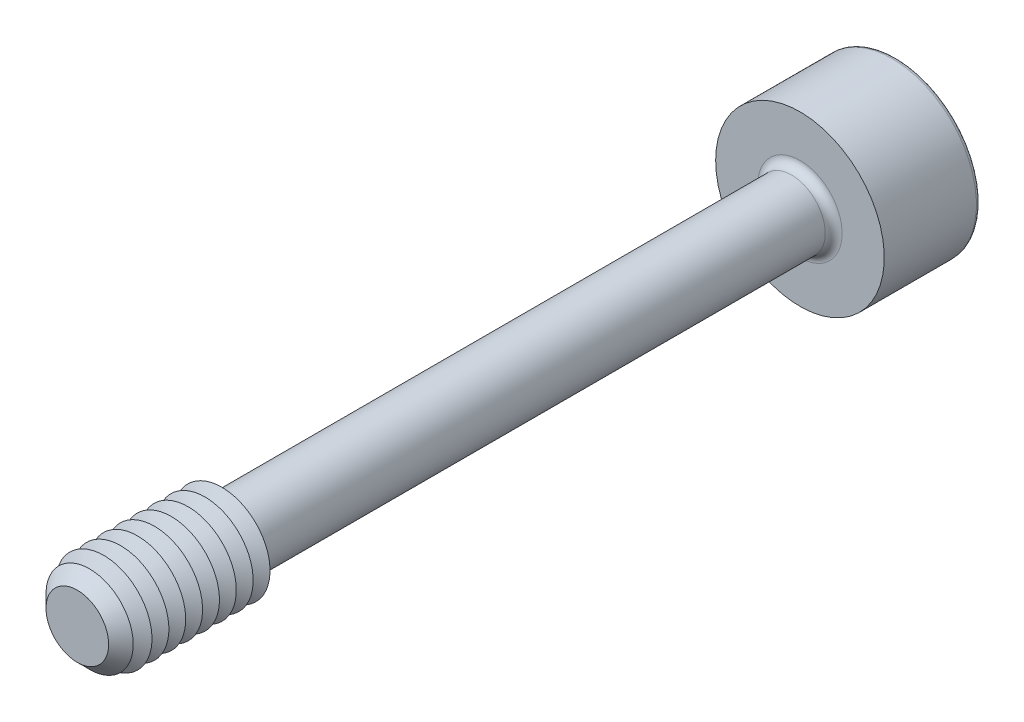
ISO-10303-21;
HEADER;
FILE_DESCRIPTION(('STEP AP214'),'2;1');
FILE_NAME('part.step','',(''),(''),'','','');
FILE_SCHEMA(('AUTOMOTIVE_DESIGN { 1 0 10303 214 1 1 1 1 }'));
ENDSEC;
DATA;
#1=APPLICATION_CONTEXT('core data for automotive mechanical design processes');
#2=APPLICATION_PROTOCOL_DEFINITION('international standard','automotive_design',2000,#1);
#3=PRODUCT_CONTEXT('',#1,'mechanical');
#4=PRODUCT('Part','Part','',(#3));
#5=PRODUCT_RELATED_PRODUCT_CATEGORY('part','',(#4));
#6=PRODUCT_DEFINITION_FORMATION('','',#4);
#7=PRODUCT_DEFINITION_CONTEXT('part definition',#1,'design');
#8=PRODUCT_DEFINITION('design','',#6,#7);
#9=PRODUCT_DEFINITION_SHAPE('','',#8);
#10=(LENGTH_UNIT() NAMED_UNIT(*) SI_UNIT(.MILLI.,.METRE.));
#11=(NAMED_UNIT(*) PLANE_ANGLE_UNIT() SI_UNIT($,.RADIAN.));
#12=(NAMED_UNIT(*) SI_UNIT($,.STERADIAN.) SOLID_ANGLE_UNIT());
#13=UNCERTAINTY_MEASURE_WITH_UNIT(LENGTH_MEASURE(1.E-05),#10,'distance_accuracy_value','');
#14=(GEOMETRIC_REPRESENTATION_CONTEXT(3) GLOBAL_UNCERTAINTY_ASSIGNED_CONTEXT((#13)) GLOBAL_UNIT_ASSIGNED_CONTEXT((#10,
#11,#12)) REPRESENTATION_CONTEXT('',''));
#15=CARTESIAN_POINT('',(0.,0.,0.));
#16=DIRECTION('',(0.,0.,1.));
#17=DIRECTION('',(1.,0.,0.));
#18=AXIS2_PLACEMENT_3D('',#15,#16,#17);
#19=CARTESIAN_POINT('',(-0.866025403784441,-1.5,-16.));
#20=DIRECTION('',(0.,0.,1.));
#21=DIRECTION('',(1.,0.,0.));
#22=AXIS2_PLACEMENT_3D('',#19,#20,#21);
#23=PLANE('',#22);
#24=DIRECTION('',(1.,0.,0.));
#25=VECTOR('',#24,1.);
#26=CARTESIAN_POINT('',(-0.866025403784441,-1.5,-16.));
#27=LINE('',#26,#25);
#28=CARTESIAN_POINT('',(0.,-1.5,-16.));
#29=VERTEX_POINT('',#28);
#30=CARTESIAN_POINT('',(0.866025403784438,-1.5,-16.));
#31=VERTEX_POINT('',#30);
#32=EDGE_CURVE('E762',#29,#31,#27,.T.);
#33=ORIENTED_EDGE('',*,*,#32,.F.);
#34=CARTESIAN_POINT('',(0.,0.,-16.));
#35=DIRECTION('',(0.,0.,1.));
#36=DIRECTION('',(0.,-1.,0.));
#37=AXIS2_PLACEMENT_3D('',#34,#35,#36);
#38=CIRCLE('',#37,1.5);
#39=CARTESIAN_POINT('',(1.29903810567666,-0.75,-16.));
#40=VERTEX_POINT('',#39);
#41=EDGE_CURVE('E53',#29,#40,#38,.T.);
#42=ORIENTED_EDGE('',*,*,#41,.T.);
#43=DIRECTION('',(0.5,0.866025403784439,0.));
#44=VECTOR('',#43,1.);
#45=CARTESIAN_POINT('',(0.866025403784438,-1.5,-16.));
#46=LINE('',#45,#44);
#47=EDGE_CURVE('E746',#31,#40,#46,.T.);
#48=ORIENTED_EDGE('',*,*,#47,.F.);
#49=EDGE_LOOP('',(#33,#42,#48));
#50=FACE_BOUND('',#49,.T.);
#51=ADVANCED_FACE('F41',(#50),#23,.F.);
#52=CARTESIAN_POINT('',(1.73205080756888,0.,-16.));
#53=VERTEX_POINT('',#52);
#54=EDGE_CURVE('E758',#40,#53,#46,.T.);
#55=ORIENTED_EDGE('',*,*,#54,.F.);
#56=CARTESIAN_POINT('',(1.29903810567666,0.749999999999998,-16.));
#57=VERTEX_POINT('',#56);
#58=EDGE_CURVE('E11',#40,#57,#38,.T.);
#59=ORIENTED_EDGE('',*,*,#58,.T.);
#60=DIRECTION('',(-0.5,0.866025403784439,0.));
#61=VECTOR('',#60,1.);
#62=CARTESIAN_POINT('',(1.73205080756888,0.,-16.));
#63=LINE('',#62,#61);
#64=EDGE_CURVE('E745',#53,#57,#63,.T.);
#65=ORIENTED_EDGE('',*,*,#64,.F.);
#66=EDGE_LOOP('',(#55,#59,#65));
#67=FACE_BOUND('',#66,.T.);
#68=ADVANCED_FACE('F133',(#67),#23,.F.);
#69=CARTESIAN_POINT('',(0.866025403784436,1.5,-16.));
#70=VERTEX_POINT('',#69);
#71=EDGE_CURVE('E740',#57,#70,#63,.T.);
#72=ORIENTED_EDGE('',*,*,#71,.F.);
#73=CARTESIAN_POINT('',(0.,1.5,-16.));
#74=VERTEX_POINT('',#73);
#75=EDGE_CURVE('E51',#57,#74,#38,.T.);
#76=ORIENTED_EDGE('',*,*,#75,.T.);
#77=DIRECTION('',(-1.,0.,0.));
#78=VECTOR('',#77,1.);
#79=CARTESIAN_POINT('',(0.866025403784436,1.5,-16.));
#80=LINE('',#79,#78);
#81=EDGE_CURVE('E177',#70,#74,#80,.T.);
#82=ORIENTED_EDGE('',*,*,#81,.F.);
#83=EDGE_LOOP('',(#72,#76,#82));
#84=FACE_BOUND('',#83,.T.);
#85=ADVANCED_FACE('F139',(#84),#23,.F.);
#86=CARTESIAN_POINT('',(-0.866025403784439,1.5,-16.));
#87=VERTEX_POINT('',#86);
#88=EDGE_CURVE('E751',#74,#87,#80,.T.);
#89=ORIENTED_EDGE('',*,*,#88,.F.);
#90=CARTESIAN_POINT('',(-1.29903810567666,0.749999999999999,-16.));
#91=VERTEX_POINT('',#90);
#92=EDGE_CURVE('E264',#74,#91,#38,.T.);
#93=ORIENTED_EDGE('',*,*,#92,.T.);
#94=DIRECTION('',(-0.5,-0.866025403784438,0.));
#95=VECTOR('',#94,1.);
#96=CARTESIAN_POINT('',(-0.866025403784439,1.5,-16.));
#97=LINE('',#96,#95);
#98=EDGE_CURVE('E176',#87,#91,#97,.T.);
#99=ORIENTED_EDGE('',*,*,#98,.F.);
#100=EDGE_LOOP('',(#89,#93,#99));
#101=FACE_BOUND('',#100,.T.);
#102=ADVANCED_FACE('F157',(#101),#23,.F.);
#103=CARTESIAN_POINT('',(-1.73205080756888,0.,-16.));
#104=VERTEX_POINT('',#103);
#105=EDGE_CURVE('E170',#91,#104,#97,.T.);
#106=ORIENTED_EDGE('',*,*,#105,.F.);
#107=CARTESIAN_POINT('',(-1.29903810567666,-0.749999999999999,-16.));
#108=VERTEX_POINT('',#107);
#109=EDGE_CURVE('E172',#91,#108,#38,.T.);
#110=ORIENTED_EDGE('',*,*,#109,.T.);
#111=DIRECTION('',(0.5,-0.866025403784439,0.));
#112=VECTOR('',#111,1.);
#113=CARTESIAN_POINT('',(-1.73205080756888,0.,-16.));
#114=LINE('',#113,#112);
#115=EDGE_CURVE('E174',#104,#108,#114,.T.);
#116=ORIENTED_EDGE('',*,*,#115,.F.);
#117=EDGE_LOOP('',(#106,#110,#116));
#118=FACE_BOUND('',#117,.T.);
#119=ADVANCED_FACE('F146',(#118),#23,.F.);
#120=CARTESIAN_POINT('',(0.,0.,-19.));
#121=DIRECTION('',(0.,0.,-1.));
#122=DIRECTION('',(-1.,0.,0.));
#123=AXIS2_PLACEMENT_3D('',#120,#121,#122);
#124=PLANE('',#123);
#125=CARTESIAN_POINT('',(0.,0.,-19.));
#126=DIRECTION('',(0.,0.,-1.));
#127=DIRECTION('',(-1.,0.,0.));
#128=AXIS2_PLACEMENT_3D('',#125,#126,#127);
#129=CIRCLE('',#128,3.325);
#130=CARTESIAN_POINT('',(-3.325,0.,-19.));
#131=VERTEX_POINT('',#130);
#132=EDGE_CURVE('E251',#131,#131,#129,.T.);
#133=ORIENTED_EDGE('',*,*,#132,.T.);
#134=EDGE_LOOP('',(#133));
#135=FACE_BOUND('',#134,.T.);
#136=DIRECTION('',(-0.5,-0.866025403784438,0.));
#137=VECTOR('',#136,1.);
#138=CARTESIAN_POINT('',(-0.866025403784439,1.5,-19.));
#139=LINE('',#138,#137);
#140=CARTESIAN_POINT('',(-0.866025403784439,1.5,-19.));
#141=VERTEX_POINT('',#140);
#142=CARTESIAN_POINT('',(-1.73205080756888,0.,-19.));
#143=VERTEX_POINT('',#142);
#144=EDGE_CURVE('E212',#141,#143,#139,.T.);
#145=ORIENTED_EDGE('',*,*,#144,.T.);
#146=DIRECTION('',(0.5,-0.866025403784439,0.));
#147=VECTOR('',#146,1.);
#148=CARTESIAN_POINT('',(-1.73205080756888,0.,-19.));
#149=LINE('',#148,#147);
#150=CARTESIAN_POINT('',(-0.866025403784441,-1.5,-19.));
#151=VERTEX_POINT('',#150);
#152=EDGE_CURVE('E67',#143,#151,#149,.T.);
#153=ORIENTED_EDGE('',*,*,#152,.T.);
#154=DIRECTION('',(1.,0.,0.));
#155=VECTOR('',#154,1.);
#156=CARTESIAN_POINT('',(-0.866025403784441,-1.5,-19.));
#157=LINE('',#156,#155);
#158=CARTESIAN_POINT('',(0.866025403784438,-1.5,-19.));
#159=VERTEX_POINT('',#158);
#160=EDGE_CURVE('E196',#151,#159,#157,.T.);
#161=ORIENTED_EDGE('',*,*,#160,.T.);
#162=DIRECTION('',(0.5,0.866025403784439,0.));
#163=VECTOR('',#162,1.);
#164=CARTESIAN_POINT('',(0.866025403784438,-1.5,-19.));
#165=LINE('',#164,#163);
#166=CARTESIAN_POINT('',(1.73205080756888,0.,-19.));
#167=VERTEX_POINT('',#166);
#168=EDGE_CURVE('E200',#159,#167,#165,.T.);
#169=ORIENTED_EDGE('',*,*,#168,.T.);
#170=DIRECTION('',(-0.5,0.866025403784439,0.));
#171=VECTOR('',#170,1.);
#172=CARTESIAN_POINT('',(1.73205080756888,0.,-19.));
#173=LINE('',#172,#171);
#174=CARTESIAN_POINT('',(0.866025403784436,1.5,-19.));
#175=VERTEX_POINT('',#174);
#176=EDGE_CURVE('E204',#167,#175,#173,.T.);
#177=ORIENTED_EDGE('',*,*,#176,.T.);
#178=DIRECTION('',(-1.,0.,0.));
#179=VECTOR('',#178,1.);
#180=CARTESIAN_POINT('',(0.866025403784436,1.5,-19.));
#181=LINE('',#180,#179);
#182=EDGE_CURVE('E208',#175,#141,#181,.T.);
#183=ORIENTED_EDGE('',*,*,#182,.T.);
#184=EDGE_LOOP('',(#145,#153,#161,#169,#177,#183));
#185=FACE_BOUND('',#184,.T.);
#186=ADVANCED_FACE('F156',(#135,#185),#124,.T.);
#187=CARTESIAN_POINT('',(0.,0.,15.));
#188=DIRECTION('',(0.,0.,-1.));
#189=DIRECTION('',(-1.,0.,0.));
#190=AXIS2_PLACEMENT_3D('',#187,#188,#189);
#191=CYLINDRICAL_SURFACE('',#190,1.4);
#192=CARTESIAN_POINT('',(0.,0.,-14.65));
#193=DIRECTION('',(0.,0.,-1.));
#194=DIRECTION('',(-1.,0.,0.));
#195=AXIS2_PLACEMENT_3D('',#192,#193,#194);
#196=CIRCLE('',#195,1.4);
#197=CARTESIAN_POINT('',(-1.4,0.,-14.65));
#198=VERTEX_POINT('',#197);
#199=EDGE_CURVE('E247',#198,#198,#196,.F.);
#200=ORIENTED_EDGE('',*,*,#199,.T.);
#201=EDGE_LOOP('',(#200));
#202=FACE_BOUND('',#201,.T.);
#203=CARTESIAN_POINT('',(0.,0.,8.65358983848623));
#204=DIRECTION('',(0.,0.,-1.));
#205=DIRECTION('',(0.,1.,0.));
#206=AXIS2_PLACEMENT_3D('',#203,#204,#205);
#207=CIRCLE('',#206,1.4);
#208=CARTESIAN_POINT('',(0.,1.4,8.65358983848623));
#209=VERTEX_POINT('',#208);
#210=EDGE_CURVE('E235',#209,#209,#207,.T.);
#211=ORIENTED_EDGE('',*,*,#210,.T.);
#212=EDGE_LOOP('',(#211));
#213=FACE_BOUND('',#212,.T.);
#214=ADVANCED_FACE('F163',(#202,#213),#191,.T.);
#215=CARTESIAN_POINT('',(0.,0.,8.65358983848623));
#216=DIRECTION('',(0.,0.,1.));
#217=DIRECTION('',(0.,-1.,0.));
#218=AXIS2_PLACEMENT_3D('',#215,#216,#217);
#219=CONICAL_SURFACE('',#218,1.4,1.0471975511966);
#220=CARTESIAN_POINT('',(0.,0.,9.));
#221=DIRECTION('',(0.,0.,-1.));
#222=DIRECTION('',(-1.,0.,0.));
#223=AXIS2_PLACEMENT_3D('',#220,#221,#222);
#224=CIRCLE('',#223,2.);
#225=CARTESIAN_POINT('',(-2.,0.,9.));
#226=VERTEX_POINT('',#225);
#227=EDGE_CURVE('E267',#226,#226,#224,.T.);
#228=ORIENTED_EDGE('',*,*,#227,.T.);
#229=EDGE_LOOP('',(#228));
#230=FACE_BOUND('',#229,.T.);
#231=ORIENTED_EDGE('',*,*,#210,.F.);
#232=EDGE_LOOP('',(#231));
#233=FACE_BOUND('',#232,.T.);
#234=ADVANCED_FACE('F509',(#230,#233),#219,.T.);
#235=CARTESIAN_POINT('',(0.,0.,-15.));
#236=DIRECTION('',(0.,0.,-1.));
#237=DIRECTION('',(-1.,0.,0.));
#238=AXIS2_PLACEMENT_3D('',#235,#236,#237);
#239=PLANE('',#238);
#240=CARTESIAN_POINT('',(0.,0.,-15.));
#241=DIRECTION('',(0.,0.,-1.));
#242=DIRECTION('',(-1.,0.,0.));
#243=AXIS2_PLACEMENT_3D('',#240,#241,#242);
#244=CIRCLE('',#243,1.75);
#245=CARTESIAN_POINT('',(-1.75,0.,-15.));
#246=VERTEX_POINT('',#245);
#247=EDGE_CURVE('E243',#246,#246,#244,.T.);
#248=ORIENTED_EDGE('',*,*,#247,.T.);
#249=EDGE_LOOP('',(#248));
#250=FACE_BOUND('',#249,.T.);
#251=CARTESIAN_POINT('',(0.,0.,-15.));
#252=DIRECTION('',(0.,0.,-1.));
#253=DIRECTION('',(-1.,0.,0.));
#254=AXIS2_PLACEMENT_3D('',#251,#252,#253);
#255=CIRCLE('',#254,3.5);
#256=CARTESIAN_POINT('',(-3.5,0.,-15.));
#257=VERTEX_POINT('',#256);
#258=EDGE_CURVE('E231',#257,#257,#255,.T.);
#259=ORIENTED_EDGE('',*,*,#258,.F.);
#260=EDGE_LOOP('',(#259));
#261=FACE_BOUND('',#260,.T.);
#262=ADVANCED_FACE('F502',(#250,#261),#239,.F.);
#263=CARTESIAN_POINT('',(0.,0.,-19.));
#264=DIRECTION('',(0.,0.,1.));
#265=DIRECTION('',(1.,0.,0.));
#266=AXIS2_PLACEMENT_3D('',#263,#264,#265);
#267=CYLINDRICAL_SURFACE('',#266,3.5);
#268=CARTESIAN_POINT('',(0.,0.,-18.825));
#269=DIRECTION('',(0.,0.,-1.));
#270=DIRECTION('',(-1.,0.,0.));
#271=AXIS2_PLACEMENT_3D('',#268,#269,#270);
#272=CIRCLE('',#271,3.5);
#273=CARTESIAN_POINT('',(-3.5,0.,-18.825));
#274=VERTEX_POINT('',#273);
#275=EDGE_CURVE('E254',#274,#274,#272,.F.);
#276=ORIENTED_EDGE('',*,*,#275,.T.);
#277=EDGE_LOOP('',(#276));
#278=FACE_BOUND('',#277,.T.);
#279=ORIENTED_EDGE('',*,*,#258,.T.);
#280=EDGE_LOOP('',(#279));
#281=FACE_BOUND('',#280,.T.);
#282=ADVANCED_FACE('F508',(#278,#281),#267,.T.);
#283=CARTESIAN_POINT('',(-1.73205080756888,0.,-16.));
#284=DIRECTION('',(0.866025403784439,0.5,0.));
#285=DIRECTION('',(-0.5,0.866025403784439,0.));
#286=AXIS2_PLACEMENT_3D('',#283,#284,#285);
#287=PLANE('',#286);
#288=ORIENTED_EDGE('',*,*,#152,.F.);
#289=DIRECTION('',(0.,0.,-1.));
#290=VECTOR('',#289,1.);
#291=CARTESIAN_POINT('',(-1.73205080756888,0.,-16.));
#292=LINE('',#291,#290);
#293=EDGE_CURVE('E186',#104,#143,#292,.T.);
#294=ORIENTED_EDGE('',*,*,#293,.F.);
#295=ORIENTED_EDGE('',*,*,#115,.T.);
#296=CARTESIAN_POINT('',(-0.866025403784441,-1.5,-16.));
#297=VERTEX_POINT('',#296);
#298=EDGE_CURVE('E215',#108,#297,#114,.T.);
#299=ORIENTED_EDGE('',*,*,#298,.T.);
#300=DIRECTION('',(0.,0.,-1.));
#301=VECTOR('',#300,1.);
#302=CARTESIAN_POINT('',(-0.866025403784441,-1.5,-16.));
#303=LINE('',#302,#301);
#304=EDGE_CURVE('E228',#297,#151,#303,.T.);
#305=ORIENTED_EDGE('',*,*,#304,.T.);
#306=EDGE_LOOP('',(#288,#294,#295,#299,#305));
#307=FACE_BOUND('',#306,.T.);
#308=ADVANCED_FACE('F520',(#307),#287,.T.);
#309=CARTESIAN_POINT('',(-0.866025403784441,-1.5,-16.));
#310=DIRECTION('',(0.,1.,0.));
#311=DIRECTION('',(0.,0.,1.));
#312=AXIS2_PLACEMENT_3D('',#309,#310,#311);
#313=PLANE('',#312);
#314=ORIENTED_EDGE('',*,*,#160,.F.);
#315=ORIENTED_EDGE('',*,*,#304,.F.);
#316=EDGE_CURVE('E759',#297,#29,#27,.T.);
#317=ORIENTED_EDGE('',*,*,#316,.T.);
#318=ORIENTED_EDGE('',*,*,#32,.T.);
#319=DIRECTION('',(0.,0.,-1.));
#320=VECTOR('',#319,1.);
#321=CARTESIAN_POINT('',(0.866025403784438,-1.5,-16.));
#322=LINE('',#321,#320);
#323=EDGE_CURVE('E225',#31,#159,#322,.T.);
#324=ORIENTED_EDGE('',*,*,#323,.T.);
#325=EDGE_LOOP('',(#314,#315,#317,#318,#324));
#326=FACE_BOUND('',#325,.T.);
#327=ADVANCED_FACE('F536',(#326),#313,.T.);
#328=CARTESIAN_POINT('',(0.866025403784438,-1.5,-16.));
#329=DIRECTION('',(-0.866025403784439,0.5,0.));
#330=DIRECTION('',(-0.5,-0.866025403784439,0.));
#331=AXIS2_PLACEMENT_3D('',#328,#329,#330);
#332=PLANE('',#331);
#333=ORIENTED_EDGE('',*,*,#168,.F.);
#334=ORIENTED_EDGE('',*,*,#323,.F.);
#335=ORIENTED_EDGE('',*,*,#47,.T.);
#336=ORIENTED_EDGE('',*,*,#54,.T.);
#337=DIRECTION('',(0.,0.,-1.));
#338=VECTOR('',#337,1.);
#339=CARTESIAN_POINT('',(1.73205080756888,0.,-16.));
#340=LINE('',#339,#338);
#341=EDGE_CURVE('E222',#53,#167,#340,.T.);
#342=ORIENTED_EDGE('',*,*,#341,.T.);
#343=EDGE_LOOP('',(#333,#334,#335,#336,#342));
#344=FACE_BOUND('',#343,.T.);
#345=ADVANCED_FACE('F546',(#344),#332,.T.);
#346=CARTESIAN_POINT('',(1.73205080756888,0.,-16.));
#347=DIRECTION('',(-0.866025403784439,-0.5,0.));
#348=DIRECTION('',(0.5,-0.866025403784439,0.));
#349=AXIS2_PLACEMENT_3D('',#346,#347,#348);
#350=PLANE('',#349);
#351=ORIENTED_EDGE('',*,*,#176,.F.);
#352=ORIENTED_EDGE('',*,*,#341,.F.);
#353=ORIENTED_EDGE('',*,*,#64,.T.);
#354=ORIENTED_EDGE('',*,*,#71,.T.);
#355=DIRECTION('',(0.,0.,-1.));
#356=VECTOR('',#355,1.);
#357=CARTESIAN_POINT('',(0.866025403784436,1.5,-16.));
#358=LINE('',#357,#356);
#359=EDGE_CURVE('E219',#70,#175,#358,.T.);
#360=ORIENTED_EDGE('',*,*,#359,.T.);
#361=EDGE_LOOP('',(#351,#352,#353,#354,#360));
#362=FACE_BOUND('',#361,.T.);
#363=ADVANCED_FACE('F556',(#362),#350,.T.);
#364=CARTESIAN_POINT('',(0.866025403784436,1.5,-16.));
#365=DIRECTION('',(0.,-1.,0.));
#366=DIRECTION('',(0.,0.,-1.));
#367=AXIS2_PLACEMENT_3D('',#364,#365,#366);
#368=PLANE('',#367);
#369=ORIENTED_EDGE('',*,*,#182,.F.);
#370=ORIENTED_EDGE('',*,*,#359,.F.);
#371=ORIENTED_EDGE('',*,*,#81,.T.);
#372=ORIENTED_EDGE('',*,*,#88,.T.);
#373=DIRECTION('',(0.,0.,-1.));
#374=VECTOR('',#373,1.);
#375=CARTESIAN_POINT('',(-0.866025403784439,1.5,-16.));
#376=LINE('',#375,#374);
#377=EDGE_CURVE('E182',#87,#141,#376,.T.);
#378=ORIENTED_EDGE('',*,*,#377,.T.);
#379=EDGE_LOOP('',(#369,#370,#371,#372,#378));
#380=FACE_BOUND('',#379,.T.);
#381=ADVANCED_FACE('F152',(#380),#368,.T.);
#382=CARTESIAN_POINT('',(-0.866025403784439,1.5,-16.));
#383=DIRECTION('',(0.866025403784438,-0.5,0.));
#384=DIRECTION('',(0.5,0.866025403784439,0.));
#385=AXIS2_PLACEMENT_3D('',#382,#383,#384);
#386=PLANE('',#385);
#387=ORIENTED_EDGE('',*,*,#144,.F.);
#388=ORIENTED_EDGE('',*,*,#377,.F.);
#389=ORIENTED_EDGE('',*,*,#98,.T.);
#390=ORIENTED_EDGE('',*,*,#105,.T.);
#391=ORIENTED_EDGE('',*,*,#293,.T.);
#392=EDGE_LOOP('',(#387,#388,#389,#390,#391));
#393=FACE_BOUND('',#392,.T.);
#394=ADVANCED_FACE('F144',(#393),#386,.T.);
#395=ORIENTED_EDGE('',*,*,#298,.F.);
#396=EDGE_CURVE('E257',#108,#29,#38,.T.);
#397=ORIENTED_EDGE('',*,*,#396,.T.);
#398=ORIENTED_EDGE('',*,*,#316,.F.);
#399=EDGE_LOOP('',(#395,#397,#398));
#400=FACE_BOUND('',#399,.T.);
#401=ADVANCED_FACE('F135',(#400),#23,.F.);
#402=CARTESIAN_POINT('',(0.,0.,-14.65));
#403=DIRECTION('',(0.,0.,-1.));
#404=DIRECTION('',(-1.,0.,0.));
#405=AXIS2_PLACEMENT_3D('',#402,#403,#404);
#406=TOROIDAL_SURFACE('',#405,1.75,0.35);
#407=ORIENTED_EDGE('',*,*,#199,.F.);
#408=EDGE_LOOP('',(#407));
#409=FACE_BOUND('',#408,.T.);
#410=ORIENTED_EDGE('',*,*,#247,.F.);
#411=EDGE_LOOP('',(#410));
#412=FACE_BOUND('',#411,.T.);
#413=ADVANCED_FACE('F129',(#409,#412),#406,.F.);
#414=CARTESIAN_POINT('',(0.,0.,-18.825));
#415=DIRECTION('',(0.,0.,-1.));
#416=DIRECTION('',(-1.,0.,0.));
#417=AXIS2_PLACEMENT_3D('',#414,#415,#416);
#418=TOROIDAL_SURFACE('',#417,3.325,0.175);
#419=ORIENTED_EDGE('',*,*,#275,.F.);
#420=EDGE_LOOP('',(#419));
#421=FACE_BOUND('',#420,.T.);
#422=ORIENTED_EDGE('',*,*,#132,.F.);
#423=EDGE_LOOP('',(#422));
#424=FACE_BOUND('',#423,.T.);
#425=ADVANCED_FACE('F43',(#421,#424),#418,.T.);
#426=CARTESIAN_POINT('',(0.,0.,-15.1339745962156));
#427=DIRECTION('',(0.,0.,-1.));
#428=DIRECTION('',(0.,1.,0.));
#429=AXIS2_PLACEMENT_3D('',#426,#427,#428);
#430=CONICAL_SURFACE('',#429,0.,1.0471975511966);
#431=ORIENTED_EDGE('',*,*,#41,.F.);
#432=ORIENTED_EDGE('',*,*,#396,.F.);
#433=ORIENTED_EDGE('',*,*,#109,.F.);
#434=ORIENTED_EDGE('',*,*,#92,.F.);
#435=ORIENTED_EDGE('',*,*,#75,.F.);
#436=ORIENTED_EDGE('',*,*,#58,.F.);
#437=EDGE_LOOP('',(#431,#432,#433,#434,#435,#436));
#438=FACE_BOUND('',#437,.T.);
#439=CARTESIAN_POINT('',(0.,0.,-15.1339745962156));
#440=VERTEX_POINT('',#439);
#441=VERTEX_LOOP('',#440);
#442=FACE_BOUND('',#441,.T.);
#443=ADVANCED_FACE('F118',(#438,#442),#430,.F.);
#444=CARTESIAN_POINT('',(0.,0.,9.35));
#445=DIRECTION('',(0.,0.,-1.));
#446=DIRECTION('',(-1.,0.,0.));
#447=AXIS2_PLACEMENT_3D('',#444,#445,#446);
#448=CONICAL_SURFACE('',#447,1.39378221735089,1.0471975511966);
#449=ORIENTED_EDGE('',*,*,#227,.F.);
#450=EDGE_LOOP('',(#449));
#451=FACE_BOUND('',#450,.T.);
#452=CARTESIAN_POINT('',(0.,0.,9.35));
#453=DIRECTION('',(0.,0.,-1.));
#454=DIRECTION('',(-1.,0.,0.));
#455=AXIS2_PLACEMENT_3D('',#452,#453,#454);
#456=CIRCLE('',#455,1.39378221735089);
#457=CARTESIAN_POINT('',(-1.39378221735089,0.,9.35));
#458=VERTEX_POINT('',#457);
#459=EDGE_CURVE('E272',#458,#458,#456,.T.);
#460=ORIENTED_EDGE('',*,*,#459,.T.);
#461=EDGE_LOOP('',(#460));
#462=FACE_BOUND('',#461,.T.);
#463=ADVANCED_FACE('F120',(#451,#462),#448,.T.);
#464=CARTESIAN_POINT('',(0.,0.,9.7));
#465=DIRECTION('',(0.,0.,1.));
#466=DIRECTION('',(1.,0.,0.));
#467=AXIS2_PLACEMENT_3D('',#464,#465,#466);
#468=CONICAL_SURFACE('',#467,2.,1.0471975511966);
#469=ORIENTED_EDGE('',*,*,#459,.F.);
#470=EDGE_LOOP('',(#469));
#471=FACE_BOUND('',#470,.T.);
#472=CARTESIAN_POINT('',(0.,0.,9.7));
#473=DIRECTION('',(0.,0.,-1.));
#474=DIRECTION('',(-1.,0.,0.));
#475=AXIS2_PLACEMENT_3D('',#472,#473,#474);
#476=CIRCLE('',#475,2.);
#477=CARTESIAN_POINT('',(-2.,0.,9.7));
#478=VERTEX_POINT('',#477);
#479=EDGE_CURVE('E278',#478,#478,#476,.T.);
#480=ORIENTED_EDGE('',*,*,#479,.T.);
#481=EDGE_LOOP('',(#480));
#482=FACE_BOUND('',#481,.T.);
#483=ADVANCED_FACE('F126',(#471,#482),#468,.T.);
#484=CARTESIAN_POINT('',(0.,0.,10.05));
#485=DIRECTION('',(0.,0.,-1.));
#486=DIRECTION('',(-1.,0.,0.));
#487=AXIS2_PLACEMENT_3D('',#484,#485,#486);
#488=CONICAL_SURFACE('',#487,1.39378221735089,1.0471975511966);
#489=ORIENTED_EDGE('',*,*,#479,.F.);
#490=EDGE_LOOP('',(#489));
#491=FACE_BOUND('',#490,.T.);
#492=CARTESIAN_POINT('',(0.,0.,10.05));
#493=DIRECTION('',(0.,0.,-1.));
#494=DIRECTION('',(-1.,0.,0.));
#495=AXIS2_PLACEMENT_3D('',#492,#493,#494);
#496=CIRCLE('',#495,1.39378221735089);
#497=CARTESIAN_POINT('',(-1.39378221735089,0.,10.05));
#498=VERTEX_POINT('',#497);
#499=EDGE_CURVE('E284',#498,#498,#496,.T.);
#500=ORIENTED_EDGE('',*,*,#499,.T.);
#501=EDGE_LOOP('',(#500));
#502=FACE_BOUND('',#501,.T.);
#503=ADVANCED_FACE('F396',(#491,#502),#488,.T.);
#504=CARTESIAN_POINT('',(0.,0.,10.4));
#505=DIRECTION('',(0.,0.,1.));
#506=DIRECTION('',(1.,0.,0.));
#507=AXIS2_PLACEMENT_3D('',#504,#505,#506);
#508=CONICAL_SURFACE('',#507,2.,1.0471975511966);
#509=ORIENTED_EDGE('',*,*,#499,.F.);
#510=EDGE_LOOP('',(#509));
#511=FACE_BOUND('',#510,.T.);
#512=CARTESIAN_POINT('',(0.,0.,10.4));
#513=DIRECTION('',(0.,0.,-1.));
#514=DIRECTION('',(-1.,0.,0.));
#515=AXIS2_PLACEMENT_3D('',#512,#513,#514);
#516=CIRCLE('',#515,2.);
#517=CARTESIAN_POINT('',(-2.,0.,10.4));
#518=VERTEX_POINT('',#517);
#519=EDGE_CURVE('E288',#518,#518,#516,.T.);
#520=ORIENTED_EDGE('',*,*,#519,.T.);
#521=EDGE_LOOP('',(#520));
#522=FACE_BOUND('',#521,.T.);
#523=ADVANCED_FACE('F392',(#511,#522),#508,.T.);
#524=CARTESIAN_POINT('',(0.,0.,10.75));
#525=DIRECTION('',(0.,0.,-1.));
#526=DIRECTION('',(-1.,0.,0.));
#527=AXIS2_PLACEMENT_3D('',#524,#525,#526);
#528=CONICAL_SURFACE('',#527,1.39378221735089,1.0471975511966);
#529=ORIENTED_EDGE('',*,*,#519,.F.);
#530=EDGE_LOOP('',(#529));
#531=FACE_BOUND('',#530,.T.);
#532=CARTESIAN_POINT('',(0.,0.,10.75));
#533=DIRECTION('',(0.,0.,-1.));
#534=DIRECTION('',(-1.,0.,0.));
#535=AXIS2_PLACEMENT_3D('',#532,#533,#534);
#536=CIRCLE('',#535,1.39378221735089);
#537=CARTESIAN_POINT('',(-1.39378221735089,0.,10.75));
#538=VERTEX_POINT('',#537);
#539=EDGE_CURVE('E292',#538,#538,#536,.T.);
#540=ORIENTED_EDGE('',*,*,#539,.T.);
#541=EDGE_LOOP('',(#540));
#542=FACE_BOUND('',#541,.T.);
#543=ADVANCED_FACE('F388',(#531,#542),#528,.T.);
#544=CARTESIAN_POINT('',(0.,0.,11.1));
#545=DIRECTION('',(0.,0.,1.));
#546=DIRECTION('',(1.,0.,0.));
#547=AXIS2_PLACEMENT_3D('',#544,#545,#546);
#548=CONICAL_SURFACE('',#547,2.,1.0471975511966);
#549=ORIENTED_EDGE('',*,*,#539,.F.);
#550=EDGE_LOOP('',(#549));
#551=FACE_BOUND('',#550,.T.);
#552=CARTESIAN_POINT('',(0.,0.,11.1));
#553=DIRECTION('',(0.,0.,-1.));
#554=DIRECTION('',(-1.,0.,0.));
#555=AXIS2_PLACEMENT_3D('',#552,#553,#554);
#556=CIRCLE('',#555,2.);
#557=CARTESIAN_POINT('',(-2.,0.,11.1));
#558=VERTEX_POINT('',#557);
#559=EDGE_CURVE('E295',#558,#558,#556,.T.);
#560=ORIENTED_EDGE('',*,*,#559,.T.);
#561=EDGE_LOOP('',(#560));
#562=FACE_BOUND('',#561,.T.);
#563=ADVANCED_FACE('F384',(#551,#562),#548,.T.);
#564=CARTESIAN_POINT('',(0.,0.,11.45));
#565=DIRECTION('',(0.,0.,-1.));
#566=DIRECTION('',(-1.,0.,0.));
#567=AXIS2_PLACEMENT_3D('',#564,#565,#566);
#568=CONICAL_SURFACE('',#567,1.39378221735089,1.0471975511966);
#569=ORIENTED_EDGE('',*,*,#559,.F.);
#570=EDGE_LOOP('',(#569));
#571=FACE_BOUND('',#570,.T.);
#572=CARTESIAN_POINT('',(0.,0.,11.45));
#573=DIRECTION('',(0.,0.,-1.));
#574=DIRECTION('',(-1.,0.,0.));
#575=AXIS2_PLACEMENT_3D('',#572,#573,#574);
#576=CIRCLE('',#575,1.39378221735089);
#577=CARTESIAN_POINT('',(-1.39378221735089,0.,11.45));
#578=VERTEX_POINT('',#577);
#579=EDGE_CURVE('E299',#578,#578,#576,.T.);
#580=ORIENTED_EDGE('',*,*,#579,.T.);
#581=EDGE_LOOP('',(#580));
#582=FACE_BOUND('',#581,.T.);
#583=ADVANCED_FACE('F380',(#571,#582),#568,.T.);
#584=CARTESIAN_POINT('',(0.,0.,11.8));
#585=DIRECTION('',(0.,0.,1.));
#586=DIRECTION('',(1.,0.,0.));
#587=AXIS2_PLACEMENT_3D('',#584,#585,#586);
#588=CONICAL_SURFACE('',#587,2.,1.0471975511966);
#589=ORIENTED_EDGE('',*,*,#579,.F.);
#590=EDGE_LOOP('',(#589));
#591=FACE_BOUND('',#590,.T.);
#592=CARTESIAN_POINT('',(0.,0.,11.8));
#593=DIRECTION('',(0.,0.,-1.));
#594=DIRECTION('',(-1.,0.,0.));
#595=AXIS2_PLACEMENT_3D('',#592,#593,#594);
#596=CIRCLE('',#595,2.);
#597=CARTESIAN_POINT('',(-2.,0.,11.8));
#598=VERTEX_POINT('',#597);
#599=EDGE_CURVE('E303',#598,#598,#596,.T.);
#600=ORIENTED_EDGE('',*,*,#599,.T.);
#601=EDGE_LOOP('',(#600));
#602=FACE_BOUND('',#601,.T.);
#603=ADVANCED_FACE('F376',(#591,#602),#588,.T.);
#604=CARTESIAN_POINT('',(0.,0.,12.15));
#605=DIRECTION('',(0.,0.,-1.));
#606=DIRECTION('',(-1.,0.,0.));
#607=AXIS2_PLACEMENT_3D('',#604,#605,#606);
#608=CONICAL_SURFACE('',#607,1.39378221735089,1.0471975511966);
#609=ORIENTED_EDGE('',*,*,#599,.F.);
#610=EDGE_LOOP('',(#609));
#611=FACE_BOUND('',#610,.T.);
#612=CARTESIAN_POINT('',(0.,0.,12.15));
#613=DIRECTION('',(0.,0.,-1.));
#614=DIRECTION('',(-1.,0.,0.));
#615=AXIS2_PLACEMENT_3D('',#612,#613,#614);
#616=CIRCLE('',#615,1.39378221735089);
#617=CARTESIAN_POINT('',(-1.39378221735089,0.,12.15));
#618=VERTEX_POINT('',#617);
#619=EDGE_CURVE('E307',#618,#618,#616,.T.);
#620=ORIENTED_EDGE('',*,*,#619,.T.);
#621=EDGE_LOOP('',(#620));
#622=FACE_BOUND('',#621,.T.);
#623=ADVANCED_FACE('F372',(#611,#622),#608,.T.);
#624=CARTESIAN_POINT('',(0.,0.,12.5));
#625=DIRECTION('',(0.,0.,1.));
#626=DIRECTION('',(1.,0.,0.));
#627=AXIS2_PLACEMENT_3D('',#624,#625,#626);
#628=CONICAL_SURFACE('',#627,2.,1.0471975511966);
#629=ORIENTED_EDGE('',*,*,#619,.F.);
#630=EDGE_LOOP('',(#629));
#631=FACE_BOUND('',#630,.T.);
#632=CARTESIAN_POINT('',(0.,0.,12.5));
#633=DIRECTION('',(0.,0.,-1.));
#634=DIRECTION('',(-1.,0.,0.));
#635=AXIS2_PLACEMENT_3D('',#632,#633,#634);
#636=CIRCLE('',#635,2.);
#637=CARTESIAN_POINT('',(-2.,0.,12.5));
#638=VERTEX_POINT('',#637);
#639=EDGE_CURVE('E310',#638,#638,#636,.T.);
#640=ORIENTED_EDGE('',*,*,#639,.T.);
#641=EDGE_LOOP('',(#640));
#642=FACE_BOUND('',#641,.T.);
#643=ADVANCED_FACE('F368',(#631,#642),#628,.T.);
#644=CARTESIAN_POINT('',(0.,0.,12.85));
#645=DIRECTION('',(0.,0.,-1.));
#646=DIRECTION('',(-1.,0.,0.));
#647=AXIS2_PLACEMENT_3D('',#644,#645,#646);
#648=CONICAL_SURFACE('',#647,1.39378221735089,1.0471975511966);
#649=ORIENTED_EDGE('',*,*,#639,.F.);
#650=EDGE_LOOP('',(#649));
#651=FACE_BOUND('',#650,.T.);
#652=CARTESIAN_POINT('',(0.,0.,12.85));
#653=DIRECTION('',(0.,0.,-1.));
#654=DIRECTION('',(-1.,0.,0.));
#655=AXIS2_PLACEMENT_3D('',#652,#653,#654);
#656=CIRCLE('',#655,1.39378221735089);
#657=CARTESIAN_POINT('',(-1.39378221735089,0.,12.85));
#658=VERTEX_POINT('',#657);
#659=EDGE_CURVE('E314',#658,#658,#656,.T.);
#660=ORIENTED_EDGE('',*,*,#659,.T.);
#661=EDGE_LOOP('',(#660));
#662=FACE_BOUND('',#661,.T.);
#663=ADVANCED_FACE('F364',(#651,#662),#648,.T.);
#664=CARTESIAN_POINT('',(0.,0.,13.2));
#665=DIRECTION('',(0.,0.,1.));
#666=DIRECTION('',(1.,0.,0.));
#667=AXIS2_PLACEMENT_3D('',#664,#665,#666);
#668=CONICAL_SURFACE('',#667,2.,1.0471975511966);
#669=ORIENTED_EDGE('',*,*,#659,.F.);
#670=EDGE_LOOP('',(#669));
#671=FACE_BOUND('',#670,.T.);
#672=CARTESIAN_POINT('',(0.,0.,13.2));
#673=DIRECTION('',(0.,0.,-1.));
#674=DIRECTION('',(-1.,0.,0.));
#675=AXIS2_PLACEMENT_3D('',#672,#673,#674);
#676=CIRCLE('',#675,2.);
#677=CARTESIAN_POINT('',(-2.,0.,13.2));
#678=VERTEX_POINT('',#677);
#679=EDGE_CURVE('E318',#678,#678,#676,.T.);
#680=ORIENTED_EDGE('',*,*,#679,.T.);
#681=EDGE_LOOP('',(#680));
#682=FACE_BOUND('',#681,.T.);
#683=ADVANCED_FACE('F360',(#671,#682),#668,.T.);
#684=CARTESIAN_POINT('',(0.,0.,13.55));
#685=DIRECTION('',(0.,0.,-1.));
#686=DIRECTION('',(-1.,0.,0.));
#687=AXIS2_PLACEMENT_3D('',#684,#685,#686);
#688=CONICAL_SURFACE('',#687,1.39378221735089,1.0471975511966);
#689=ORIENTED_EDGE('',*,*,#679,.F.);
#690=EDGE_LOOP('',(#689));
#691=FACE_BOUND('',#690,.T.);
#692=CARTESIAN_POINT('',(0.,0.,13.55));
#693=DIRECTION('',(0.,0.,-1.));
#694=DIRECTION('',(-1.,0.,0.));
#695=AXIS2_PLACEMENT_3D('',#692,#693,#694);
#696=CIRCLE('',#695,1.39378221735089);
#697=CARTESIAN_POINT('',(-1.39378221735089,0.,13.55));
#698=VERTEX_POINT('',#697);
#699=EDGE_CURVE('E322',#698,#698,#696,.T.);
#700=ORIENTED_EDGE('',*,*,#699,.T.);
#701=EDGE_LOOP('',(#700));
#702=FACE_BOUND('',#701,.T.);
#703=ADVANCED_FACE('F356',(#691,#702),#688,.T.);
#704=CARTESIAN_POINT('',(0.,0.,13.9));
#705=DIRECTION('',(0.,0.,1.));
#706=DIRECTION('',(1.,0.,0.));
#707=AXIS2_PLACEMENT_3D('',#704,#705,#706);
#708=CONICAL_SURFACE('',#707,2.,1.0471975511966);
#709=ORIENTED_EDGE('',*,*,#699,.F.);
#710=EDGE_LOOP('',(#709));
#711=FACE_BOUND('',#710,.T.);
#712=CARTESIAN_POINT('',(0.,0.,13.9));
#713=DIRECTION('',(0.,0.,-1.));
#714=DIRECTION('',(-1.,0.,0.));
#715=AXIS2_PLACEMENT_3D('',#712,#713,#714);
#716=CIRCLE('',#715,2.);
#717=CARTESIAN_POINT('',(-2.,0.,13.9));
#718=VERTEX_POINT('',#717);
#719=EDGE_CURVE('E326',#718,#718,#716,.T.);
#720=ORIENTED_EDGE('',*,*,#719,.T.);
#721=EDGE_LOOP('',(#720));
#722=FACE_BOUND('',#721,.T.);
#723=ADVANCED_FACE('F349',(#711,#722),#708,.T.);
#724=CARTESIAN_POINT('',(0.,0.,14.25));
#725=DIRECTION('',(0.,0.,-1.));
#726=DIRECTION('',(-1.,0.,0.));
#727=AXIS2_PLACEMENT_3D('',#724,#725,#726);
#728=CONICAL_SURFACE('',#727,1.39378221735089,1.0471975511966);
#729=ORIENTED_EDGE('',*,*,#719,.F.);
#730=EDGE_LOOP('',(#729));
#731=FACE_BOUND('',#730,.T.);
#732=CARTESIAN_POINT('',(0.,0.,14.25));
#733=DIRECTION('',(0.,0.,-1.));
#734=DIRECTION('',(-1.,0.,0.));
#735=AXIS2_PLACEMENT_3D('',#732,#733,#734);
#736=CIRCLE('',#735,1.39378221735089);
#737=CARTESIAN_POINT('',(-1.39378221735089,0.,14.25));
#738=VERTEX_POINT('',#737);
#739=EDGE_CURVE('E330',#738,#738,#736,.T.);
#740=ORIENTED_EDGE('',*,*,#739,.T.);
#741=EDGE_LOOP('',(#740));
#742=FACE_BOUND('',#741,.T.);
#743=ADVANCED_FACE('F335',(#731,#742),#728,.T.);
#744=CARTESIAN_POINT('',(0.,0.,14.6));
#745=DIRECTION('',(0.,0.,1.));
#746=DIRECTION('',(1.,0.,0.));
#747=AXIS2_PLACEMENT_3D('',#744,#745,#746);
#748=CONICAL_SURFACE('',#747,2.,1.0471975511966);
#749=CARTESIAN_POINT('',(0.,0.,14.4901923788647));
#750=DIRECTION('',(0.,0.,1.));
#751=DIRECTION('',(1.,0.,0.));
#752=AXIS2_PLACEMENT_3D('',#749,#750,#751);
#753=CIRCLE('',#752,1.80980762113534);
#754=CARTESIAN_POINT('',(1.80980762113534,0.,14.4901923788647));
#755=VERTEX_POINT('',#754);
#756=EDGE_CURVE('E45',#755,#755,#753,.F.);
#757=ORIENTED_EDGE('',*,*,#756,.T.);
#758=EDGE_LOOP('',(#757));
#759=FACE_BOUND('',#758,.T.);
#760=ORIENTED_EDGE('',*,*,#739,.F.);
#761=EDGE_LOOP('',(#760));
#762=FACE_BOUND('',#761,.T.);
#763=ADVANCED_FACE('F337',(#759,#762),#748,.T.);
#764=CARTESIAN_POINT('',(0.,0.,15.));
#765=DIRECTION('',(0.,0.,1.));
#766=DIRECTION('',(1.,0.,0.));
#767=AXIS2_PLACEMENT_3D('',#764,#765,#766);
#768=PLANE('',#767);
#769=CARTESIAN_POINT('',(0.,0.,15.));
#770=DIRECTION('',(0.,0.,1.));
#771=DIRECTION('',(1.,0.,0.));
#772=AXIS2_PLACEMENT_3D('',#769,#770,#771);
#773=CIRCLE('',#772,1.3);
#774=CARTESIAN_POINT('',(1.3,0.,15.));
#775=VERTEX_POINT('',#774);
#776=EDGE_CURVE('E239',#775,#775,#773,.T.);
#777=ORIENTED_EDGE('',*,*,#776,.T.);
#778=EDGE_LOOP('',(#777));
#779=FACE_BOUND('',#778,.T.);
#780=ADVANCED_FACE('F339',(#779),#768,.T.);
#781=CARTESIAN_POINT('',(0.,0.,14.3));
#782=DIRECTION('',(0.,0.,-1.));
#783=DIRECTION('',(0.,1.,0.));
#784=AXIS2_PLACEMENT_3D('',#781,#782,#783);
#785=CONICAL_SURFACE('',#784,2.,0.785398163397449);
#786=ORIENTED_EDGE('',*,*,#756,.F.);
#787=EDGE_LOOP('',(#786));
#788=FACE_BOUND('',#787,.T.);
#789=ORIENTED_EDGE('',*,*,#776,.F.);
#790=EDGE_LOOP('',(#789));
#791=FACE_BOUND('',#790,.T.);
#792=ADVANCED_FACE('F346',(#788,#791),#785,.T.);
#793=CLOSED_SHELL('',(#51,#68,#85,#102,#119,#186,#214,#234,#262,#282,#308,#327,#345,#363,#381,
#394,#401,#413,#425,#443,#463,#483,#503,#523,#543,#563,#583,#603,#623,#643,#663,#683,#703,#723,
#743,#763,#780,#792));
#794=MANIFOLD_SOLID_BREP('B2',#793);
#795=ADVANCED_BREP_SHAPE_REPRESENTATION('',(#18,#794),#14);
#796=SHAPE_DEFINITION_REPRESENTATION(#9,#795);
ENDSEC;
END-ISO-10303-21;
